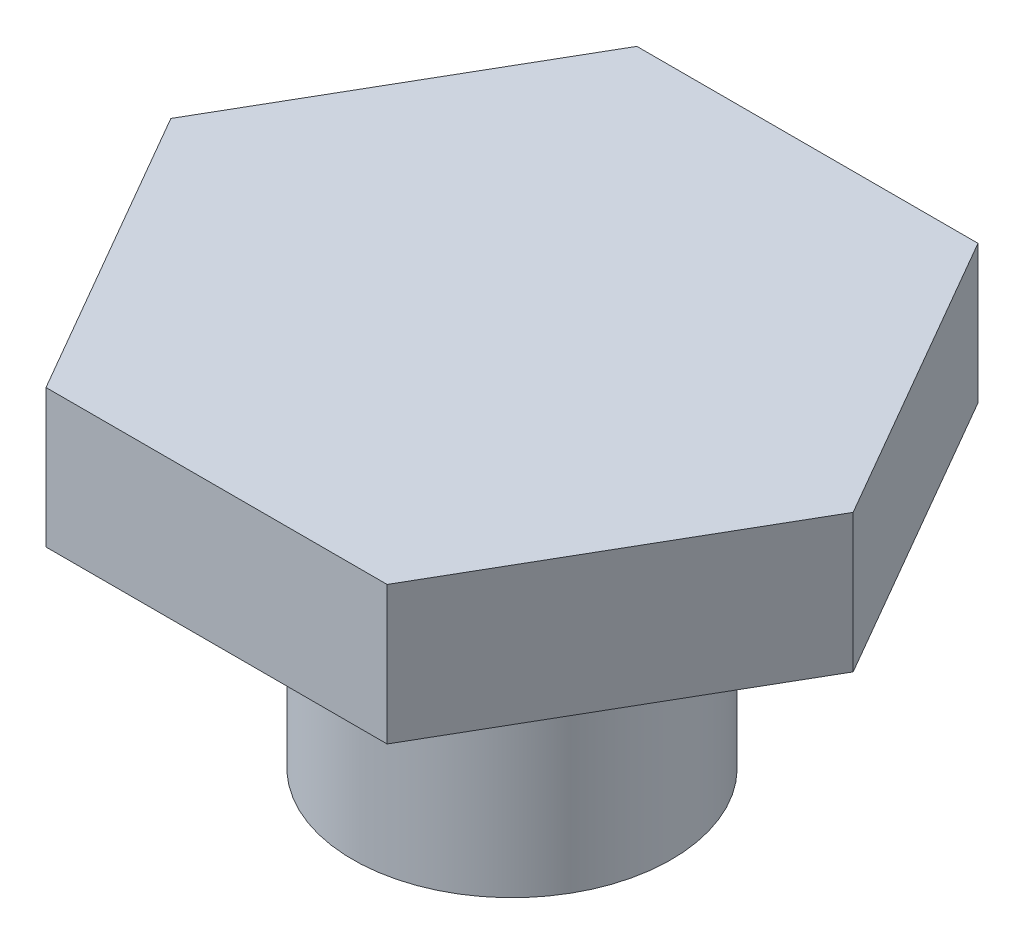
from build123d import *

# Parameters (mm, degrees)
SKETCH8_R   = 9.922482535
HEX_2_DEPTH = 4.826


with BuildPart() as part:
    # Sketch6 → Revolve1 (revolve)
    with BuildSketch(Plane.XY, mode=Mode.PRIVATE) as revolve1_sk:
        Polygon((0, -7.5946), (4.6228, -7.5946), (5.5626, -7.052006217), (5.5626, -1.228393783), (4.6228, -0.6858), (4.6228, 1.5494), (6.9977, 1.5494), (6.9977, 2.8194), (9.5631, 2.8194), (9.5631, 1.8034), (10.31875, 1.8034), (10.31875, 6.6294), (0, 6.6294), align=None)
    revolve(revolve1_sk.sketch.rotate(Axis((0, 0, 0), (0, 1, 0)), 90), axis=Axis((0, 0, 0), (0, 1, 0)))

    # Sketch8 → Hex 2 (add)
    with BuildSketch(Plane.XZ.offset(-1.8034)):
        Polygon((5.95753309, -10.31875), (11.91506618, 0), (5.95753309, 10.31875), (-5.95753309, 10.31875), (-11.91506618, 0), (-5.95753309, -10.31875), align=None)
        Circle(SKETCH8_R, mode=Mode.SUBTRACT)
    extrude(amount=-HEX_2_DEPTH)


solid = part.part
